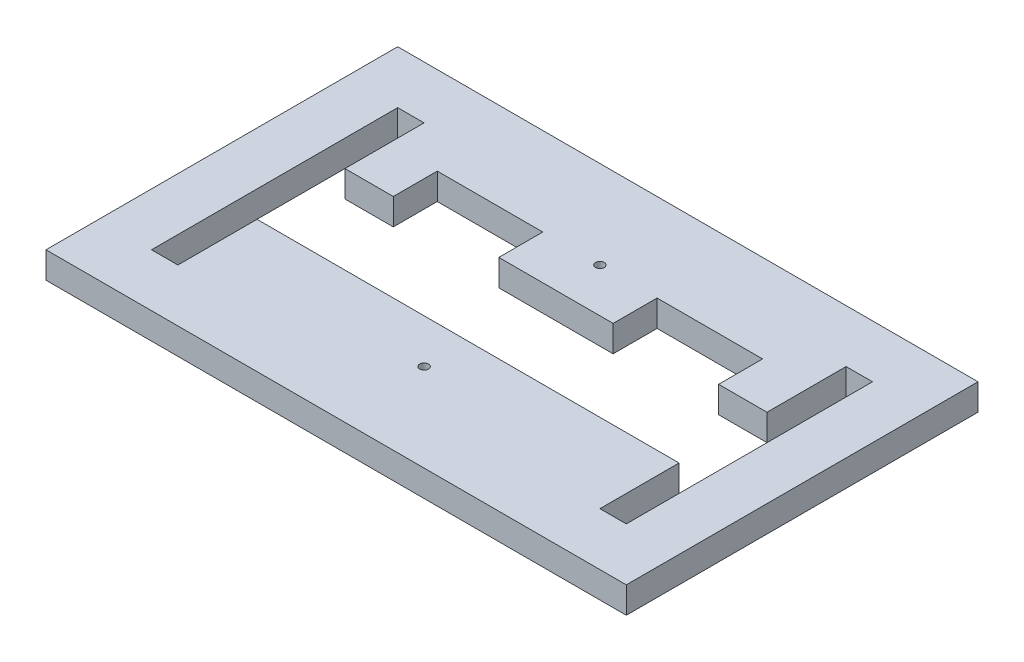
from build123d import *

# Parameters (mm, degrees)
SKETCH1_W           = 66
SKETCH1_H           = 40
BOSS_EXTRUDE1_DEPTH = 3
CUT_EXTRUDE1_REACH  = 40.704
SKETCH2_R           = 1.75
SKETCH2_W           = 3
SKETCH2_H           = 28
SKETCH3_W           = 48
SKETCH3_H           = 10
CUT_EXTRUDE2_DEPTH  = 10
SKETCH4_R           = 0.5
SKETCH4_W           = 12
SKETCH4_H           = 5
CUT_EXTRUDE3_DEPTH  = 10


with BuildPart() as part:
    # Sketch1 → Boss-Extrude1 (new body)
    with BuildSketch(Plane(origin=(0, 0, 0), x_dir=(1, 0, 0), z_dir=(0, 1, 0))):
        Rectangle(SKETCH1_W, SKETCH1_H)
    extrude(amount=BOSS_EXTRUDE1_DEPTH)

    # Sketch2 → Cut-Extrude1 (cut, up to next)
    with BuildSketch(Plane(origin=(0, 0, 0), x_dir=(1, 0, 0), z_dir=(0, 1, 0)), mode=Mode.PRIVATE) as cut_extrude1_sk1:
        with Locations(Location((0, 0, 0), (0, 0, 90))):
            Circle(SKETCH2_R)
    cut_extrude1_tool1 = extrude(cut_extrude1_sk1.sketch, amount=CUT_EXTRUDE1_REACH, mode=Mode.PRIVATE) & part.part
    # Sketch2 → Cut-Extrude1 (cut, up to next)
    with BuildSketch(Plane(origin=(0, 0, 0), x_dir=(1, 0, 0), z_dir=(0, 1, 0)), mode=Mode.PRIVATE) as cut_extrude1_sk2:
        with Locations((-25.5, 0)):
            Rectangle(SKETCH2_W, SKETCH2_H)
    cut_extrude1_tool2 = extrude(cut_extrude1_sk2.sketch, amount=CUT_EXTRUDE1_REACH, mode=Mode.PRIVATE) & part.part
    # Sketch2 → Cut-Extrude1 (cut, up to next)
    with BuildSketch(Plane(origin=(0, 0, 0), x_dir=(1, 0, 0), z_dir=(0, 1, 0)), mode=Mode.PRIVATE) as cut_extrude1_sk3:
        with Locations((25.5, 0)):
            Rectangle(SKETCH2_W, SKETCH2_H)
    cut_extrude1_tool3 = extrude(cut_extrude1_sk3.sketch, amount=CUT_EXTRUDE1_REACH, mode=Mode.PRIVATE) & part.part
    add(cut_extrude1_tool1.solids().sort_by_distance((0, 0, 0))[0], mode=Mode.SUBTRACT)
    add(cut_extrude1_tool2.solids().sort_by_distance((-25.5, 0, 0))[0], mode=Mode.SUBTRACT)
    add(cut_extrude1_tool3.solids().sort_by_distance((25.5, 0, 0))[0], mode=Mode.SUBTRACT)

    # Sketch3 → Cut-Extrude2 (cut)
    with BuildSketch(Plane(origin=(0, 0, 0), x_dir=(1, 0, 0), z_dir=(0, 1, 0))):
        Rectangle(SKETCH3_W, SKETCH3_H)
    extrude(amount=CUT_EXTRUDE2_DEPTH, mode=Mode.SUBTRACT)

    # Sketch4 → Cut-Extrude3 (cut)
    with BuildSketch(Plane(origin=(0, 0, 0), x_dir=(1, 0, 0), z_dir=(0, 1, 0))):
        with Locations(Location((0, 10, 0), (0, 0, 270))):
            Circle(SKETCH4_R)
        with Locations(Location((0, -10, 0), (0, 0, 90))):
            Circle(SKETCH4_R)
        with Locations((-12.5, 7.5)):
            Rectangle(SKETCH4_W, SKETCH4_H)
        with Locations((12.5, 7.5)):
            Rectangle(SKETCH4_W, SKETCH4_H)
    extrude(amount=CUT_EXTRUDE3_DEPTH, mode=Mode.SUBTRACT)


solid = part.part
